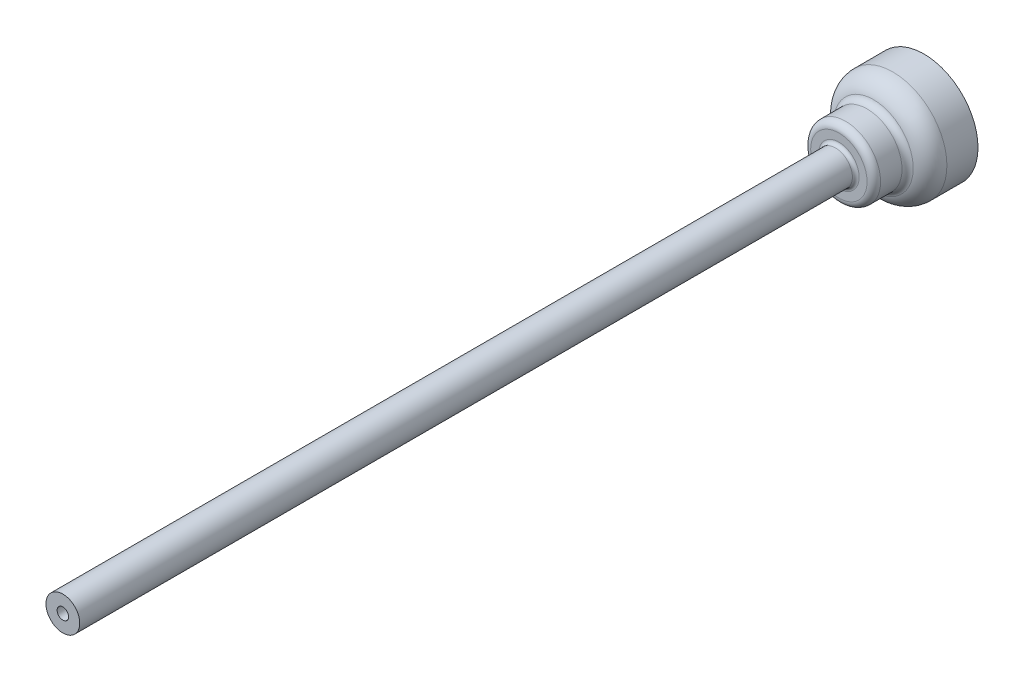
ISO-10303-21;
HEADER;
FILE_DESCRIPTION(('STEP AP214'),'2;1');
FILE_NAME('part.step','',(''),(''),'','','');
FILE_SCHEMA(('AUTOMOTIVE_DESIGN { 1 0 10303 214 1 1 1 1 }'));
ENDSEC;
DATA;
#1=APPLICATION_CONTEXT('core data for automotive mechanical design processes');
#2=APPLICATION_PROTOCOL_DEFINITION('international standard','automotive_design',2000,#1);
#3=PRODUCT_CONTEXT('',#1,'mechanical');
#4=PRODUCT('Part','Part','',(#3));
#5=PRODUCT_RELATED_PRODUCT_CATEGORY('part','',(#4));
#6=PRODUCT_DEFINITION_FORMATION('','',#4);
#7=PRODUCT_DEFINITION_CONTEXT('part definition',#1,'design');
#8=PRODUCT_DEFINITION('design','',#6,#7);
#9=PRODUCT_DEFINITION_SHAPE('','',#8);
#10=(LENGTH_UNIT() NAMED_UNIT(*) SI_UNIT(.MILLI.,.METRE.));
#11=(NAMED_UNIT(*) PLANE_ANGLE_UNIT() SI_UNIT($,.RADIAN.));
#12=(NAMED_UNIT(*) SI_UNIT($,.STERADIAN.) SOLID_ANGLE_UNIT());
#13=UNCERTAINTY_MEASURE_WITH_UNIT(LENGTH_MEASURE(1.E-05),#10,'distance_accuracy_value','');
#14=(GEOMETRIC_REPRESENTATION_CONTEXT(3) GLOBAL_UNCERTAINTY_ASSIGNED_CONTEXT((#13)) GLOBAL_UNIT_ASSIGNED_CONTEXT((#10,
#11,#12)) REPRESENTATION_CONTEXT('',''));
#15=CARTESIAN_POINT('',(0.,0.,0.));
#16=DIRECTION('',(0.,0.,1.));
#17=DIRECTION('',(1.,0.,0.));
#18=AXIS2_PLACEMENT_3D('',#15,#16,#17);
#19=CARTESIAN_POINT('',(0.,0.,50.));
#20=DIRECTION('',(0.,0.,-1.));
#21=DIRECTION('',(-1.,0.,0.));
#22=AXIS2_PLACEMENT_3D('',#19,#20,#21);
#23=CYLINDRICAL_SURFACE('',#22,0.55);
#24=CARTESIAN_POINT('',(0.,0.,46.9962214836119));
#25=DIRECTION('',(0.,0.,-1.));
#26=DIRECTION('',(-1.,0.,0.));
#27=AXIS2_PLACEMENT_3D('',#24,#25,#26);
#28=CIRCLE('',#27,0.55);
#29=CARTESIAN_POINT('',(0.55,0.,46.9962214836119));
#30=VERTEX_POINT('',#29);
#31=CARTESIAN_POINT('',(0.,-0.55,46.9962214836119));
#32=VERTEX_POINT('',#31);
#33=EDGE_CURVE('E147',#30,#32,#28,.T.);
#34=ORIENTED_EDGE('',*,*,#33,.T.);
#35=CARTESIAN_POINT('',(0.,0.,46.9962214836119));
#36=DIRECTION('',(0.,0.,-1.));
#37=DIRECTION('',(-1.,0.,0.));
#38=AXIS2_PLACEMENT_3D('',#35,#36,#37);
#39=CIRCLE('',#38,0.55);
#40=EDGE_CURVE('E162',#32,#30,#39,.T.);
#41=ORIENTED_EDGE('',*,*,#40,.T.);
#42=DIRECTION('',(0.,0.,1.));
#43=VECTOR('',#42,1.);
#44=CARTESIAN_POINT('',(0.55,0.,50.));
#45=LINE('',#44,#43);
#46=CARTESIAN_POINT('',(0.55,0.,70.));
#47=VERTEX_POINT('',#46);
#48=EDGE_CURVE('E11',#30,#47,#45,.T.);
#49=ORIENTED_EDGE('',*,*,#48,.T.);
#50=CARTESIAN_POINT('',(0.,0.,70.));
#51=DIRECTION('',(0.,0.,1.));
#52=DIRECTION('',(-1.,0.,0.));
#53=AXIS2_PLACEMENT_3D('',#50,#51,#52);
#54=CIRCLE('',#53,0.55);
#55=EDGE_CURVE('E180',#47,#47,#54,.T.);
#56=ORIENTED_EDGE('',*,*,#55,.T.);
#57=ORIENTED_EDGE('',*,*,#48,.F.);
#58=EDGE_LOOP('',(#34,#41,#49,#56,#57));
#59=FACE_BOUND('',#58,.T.);
#60=ADVANCED_FACE('F17',(#59),#23,.F.);
#61=CARTESIAN_POINT('',(0.,0.,50.));
#62=DIRECTION('',(0.,0.,1.));
#63=DIRECTION('',(-1.,0.,0.));
#64=AXIS2_PLACEMENT_3D('',#61,#62,#63);
#65=CYLINDRICAL_SURFACE('',#64,0.3429);
#66=CARTESIAN_POINT('',(0.,0.,72.5));
#67=DIRECTION('',(0.,0.,-1.));
#68=DIRECTION('',(-1.,0.,0.));
#69=AXIS2_PLACEMENT_3D('',#66,#67,#68);
#70=CIRCLE('',#69,0.3429);
#71=CARTESIAN_POINT('',(0.3429,0.,72.5));
#72=VERTEX_POINT('',#71);
#73=EDGE_CURVE('E163',#72,#72,#70,.T.);
#74=ORIENTED_EDGE('',*,*,#73,.F.);
#75=DIRECTION('',(0.,0.,-1.));
#76=VECTOR('',#75,1.);
#77=CARTESIAN_POINT('',(0.3429,0.,50.));
#78=LINE('',#77,#76);
#79=CARTESIAN_POINT('',(0.3429,0.,70.));
#80=VERTEX_POINT('',#79);
#81=EDGE_CURVE('E20',#72,#80,#78,.T.);
#82=ORIENTED_EDGE('',*,*,#81,.T.);
#83=CARTESIAN_POINT('',(0.,0.,70.));
#84=DIRECTION('',(0.,0.,-1.));
#85=DIRECTION('',(-1.,0.,0.));
#86=AXIS2_PLACEMENT_3D('',#83,#84,#85);
#87=CIRCLE('',#86,0.3429);
#88=EDGE_CURVE('E176',#80,#80,#87,.T.);
#89=ORIENTED_EDGE('',*,*,#88,.T.);
#90=ORIENTED_EDGE('',*,*,#81,.F.);
#91=EDGE_LOOP('',(#74,#82,#89,#90));
#92=FACE_BOUND('',#91,.T.);
#93=ADVANCED_FACE('F249',(#92),#65,.F.);
#94=CARTESIAN_POINT('',(0.,0.,52.5));
#95=DIRECTION('',(0.,0.,1.));
#96=DIRECTION('',(-1.,0.,0.));
#97=AXIS2_PLACEMENT_3D('',#94,#95,#96);
#98=CYLINDRICAL_SURFACE('',#97,0.85);
#99=CARTESIAN_POINT('',(0.,0.,172.5));
#100=DIRECTION('',(0.,0.,-1.));
#101=DIRECTION('',(-1.,0.,0.));
#102=AXIS2_PLACEMENT_3D('',#99,#100,#101);
#103=CIRCLE('',#102,0.85);
#104=CARTESIAN_POINT('',(0.85,0.,172.5));
#105=VERTEX_POINT('',#104);
#106=EDGE_CURVE('E140',#105,#105,#103,.T.);
#107=ORIENTED_EDGE('',*,*,#106,.F.);
#108=DIRECTION('',(0.,0.,-1.));
#109=VECTOR('',#108,1.);
#110=CARTESIAN_POINT('',(0.85,0.,52.5));
#111=LINE('',#110,#109);
#112=CARTESIAN_POINT('',(0.85,0.,72.5));
#113=VERTEX_POINT('',#112);
#114=EDGE_CURVE('E238',#105,#113,#111,.T.);
#115=ORIENTED_EDGE('',*,*,#114,.T.);
#116=CARTESIAN_POINT('',(0.,0.,72.5));
#117=DIRECTION('',(0.,0.,-1.));
#118=DIRECTION('',(-1.,0.,0.));
#119=AXIS2_PLACEMENT_3D('',#116,#117,#118);
#120=CIRCLE('',#119,0.85);
#121=EDGE_CURVE('E167',#113,#113,#120,.T.);
#122=ORIENTED_EDGE('',*,*,#121,.T.);
#123=ORIENTED_EDGE('',*,*,#114,.F.);
#124=EDGE_LOOP('',(#107,#115,#122,#123));
#125=FACE_BOUND('',#124,.T.);
#126=ADVANCED_FACE('F259',(#125),#98,.F.);
#127=CARTESIAN_POINT('',(0.,0.,50.));
#128=DIRECTION('',(0.,0.,-1.));
#129=DIRECTION('',(-1.,0.,0.));
#130=AXIS2_PLACEMENT_3D('',#127,#128,#129);
#131=CYLINDRICAL_SURFACE('',#130,8.);
#132=CARTESIAN_POINT('',(0.,0.,45.));
#133=DIRECTION('',(0.,0.,-1.));
#134=DIRECTION('',(-1.,0.,0.));
#135=AXIS2_PLACEMENT_3D('',#132,#133,#134);
#136=CIRCLE('',#135,8.);
#137=CARTESIAN_POINT('',(8.,0.,45.));
#138=VERTEX_POINT('',#137);
#139=CARTESIAN_POINT('',(0.,-8.,45.));
#140=VERTEX_POINT('',#139);
#141=EDGE_CURVE('E177',#138,#140,#136,.T.);
#142=ORIENTED_EDGE('',*,*,#141,.F.);
#143=DIRECTION('',(0.,0.,1.));
#144=VECTOR('',#143,1.);
#145=CARTESIAN_POINT('',(8.,0.,50.));
#146=LINE('',#145,#144);
#147=CARTESIAN_POINT('',(8.,0.,49.6051085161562));
#148=VERTEX_POINT('',#147);
#149=EDGE_CURVE('E38',#138,#148,#146,.T.);
#150=ORIENTED_EDGE('',*,*,#149,.T.);
#151=CARTESIAN_POINT('',(0.,0.,49.6051085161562));
#152=DIRECTION('',(0.,0.,1.));
#153=DIRECTION('',(1.,0.,0.));
#154=AXIS2_PLACEMENT_3D('',#151,#152,#153);
#155=CIRCLE('',#154,8.);
#156=CARTESIAN_POINT('',(-8.,0.,49.6051085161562));
#157=VERTEX_POINT('',#156);
#158=EDGE_CURVE('E154',#157,#148,#155,.T.);
#159=ORIENTED_EDGE('',*,*,#158,.F.);
#160=CARTESIAN_POINT('',(0.,0.,49.6051085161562));
#161=DIRECTION('',(0.,0.,1.));
#162=DIRECTION('',(1.,0.,0.));
#163=AXIS2_PLACEMENT_3D('',#160,#161,#162);
#164=CIRCLE('',#163,8.);
#165=EDGE_CURVE('E156',#148,#157,#164,.T.);
#166=ORIENTED_EDGE('',*,*,#165,.F.);
#167=ORIENTED_EDGE('',*,*,#149,.F.);
#168=CARTESIAN_POINT('',(0.,0.,45.));
#169=DIRECTION('',(0.,0.,-1.));
#170=DIRECTION('',(-1.,0.,0.));
#171=AXIS2_PLACEMENT_3D('',#168,#169,#170);
#172=CIRCLE('',#171,8.);
#173=EDGE_CURVE('E181',#140,#138,#172,.T.);
#174=ORIENTED_EDGE('',*,*,#173,.F.);
#175=EDGE_LOOP('',(#142,#150,#159,#166,#167,#174));
#176=FACE_BOUND('',#175,.T.);
#177=ADVANCED_FACE('F279',(#176),#131,.T.);
#178=CARTESIAN_POINT('',(0.,0.,49.6051085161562));
#179=DIRECTION('',(0.,0.,-1.));
#180=DIRECTION('',(1.,0.,0.));
#181=AXIS2_PLACEMENT_3D('',#178,#179,#180);
#182=TOROIDAL_SURFACE('',#181,5.,3.);
#183=ORIENTED_EDGE('',*,*,#158,.T.);
#184=ORIENTED_EDGE('',*,*,#165,.T.);
#185=CARTESIAN_POINT('',(-5.,0.,49.6051085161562));
#186=DIRECTION('',(0.,1.,0.));
#187=DIRECTION('',(-1.,0.,0.));
#188=AXIS2_PLACEMENT_3D('',#185,#186,#187);
#189=CIRCLE('',#188,3.);
#190=CARTESIAN_POINT('',(-5.88125,0.,52.4727553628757));
#191=VERTEX_POINT('',#190);
#192=EDGE_CURVE('E48',#157,#191,#189,.T.);
#193=ORIENTED_EDGE('',*,*,#192,.T.);
#194=CARTESIAN_POINT('',(0.,0.,52.4727553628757));
#195=DIRECTION('',(0.,0.,1.));
#196=DIRECTION('',(1.,0.,0.));
#197=AXIS2_PLACEMENT_3D('',#194,#195,#196);
#198=CIRCLE('',#197,5.88125);
#199=CARTESIAN_POINT('',(5.88125,0.,52.4727553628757));
#200=VERTEX_POINT('',#199);
#201=EDGE_CURVE('E227',#200,#191,#198,.T.);
#202=ORIENTED_EDGE('',*,*,#201,.F.);
#203=CARTESIAN_POINT('',(0.,0.,52.4727553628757));
#204=DIRECTION('',(0.,0.,1.));
#205=DIRECTION('',(1.,0.,0.));
#206=AXIS2_PLACEMENT_3D('',#203,#204,#205);
#207=CIRCLE('',#206,5.88125);
#208=EDGE_CURVE('E157',#191,#200,#207,.T.);
#209=ORIENTED_EDGE('',*,*,#208,.F.);
#210=ORIENTED_EDGE('',*,*,#192,.F.);
#211=EDGE_LOOP('',(#183,#184,#193,#202,#209,#210));
#212=FACE_BOUND('',#211,.T.);
#213=ADVANCED_FACE('F280',(#212),#182,.T.);
#214=CARTESIAN_POINT('',(0.,0.,53.4286376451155));
#215=DIRECTION('',(0.,0.,-1.));
#216=DIRECTION('',(-1.,0.,0.));
#217=AXIS2_PLACEMENT_3D('',#214,#215,#216);
#218=TOROIDAL_SURFACE('',#217,6.175,1.);
#219=CARTESIAN_POINT('',(0.,0.,53.4286376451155));
#220=DIRECTION('',(0.,0.,-1.));
#221=DIRECTION('',(1.,0.,0.));
#222=AXIS2_PLACEMENT_3D('',#219,#220,#221);
#223=CIRCLE('',#222,5.175);
#224=CARTESIAN_POINT('',(5.175,0.,53.4286376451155));
#225=VERTEX_POINT('',#224);
#226=EDGE_CURVE('E213',#225,#225,#223,.T.);
#227=ORIENTED_EDGE('',*,*,#226,.T.);
#228=CARTESIAN_POINT('',(6.175,0.,53.4286376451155));
#229=DIRECTION('',(0.,-1.,0.));
#230=DIRECTION('',(1.,0.,0.));
#231=AXIS2_PLACEMENT_3D('',#228,#229,#230);
#232=CIRCLE('',#231,1.);
#233=EDGE_CURVE('E223',#225,#200,#232,.T.);
#234=ORIENTED_EDGE('',*,*,#233,.T.);
#235=ORIENTED_EDGE('',*,*,#201,.T.);
#236=ORIENTED_EDGE('',*,*,#208,.T.);
#237=ORIENTED_EDGE('',*,*,#233,.F.);
#238=EDGE_LOOP('',(#227,#234,#235,#236,#237));
#239=FACE_BOUND('',#238,.T.);
#240=ADVANCED_FACE('F282',(#239),#218,.F.);
#241=CARTESIAN_POINT('',(0.,0.,52.6));
#242=DIRECTION('',(0.,0.,1.));
#243=DIRECTION('',(-1.,0.,0.));
#244=AXIS2_PLACEMENT_3D('',#241,#242,#243);
#245=CYLINDRICAL_SURFACE('',#244,5.175);
#246=CARTESIAN_POINT('',(0.,0.,56.6));
#247=DIRECTION('',(0.,0.,1.));
#248=DIRECTION('',(-1.,0.,0.));
#249=AXIS2_PLACEMENT_3D('',#246,#247,#248);
#250=CIRCLE('',#249,5.175);
#251=CARTESIAN_POINT('',(5.175,0.,56.6));
#252=VERTEX_POINT('',#251);
#253=CARTESIAN_POINT('',(-5.175,0.,56.6));
#254=VERTEX_POINT('',#253);
#255=EDGE_CURVE('E214',#252,#254,#250,.T.);
#256=ORIENTED_EDGE('',*,*,#255,.F.);
#257=DIRECTION('',(0.,0.,-1.));
#258=VECTOR('',#257,1.);
#259=CARTESIAN_POINT('',(5.175,0.,52.6));
#260=LINE('',#259,#258);
#261=EDGE_CURVE('E209',#252,#225,#260,.T.);
#262=ORIENTED_EDGE('',*,*,#261,.T.);
#263=ORIENTED_EDGE('',*,*,#226,.F.);
#264=ORIENTED_EDGE('',*,*,#261,.F.);
#265=CARTESIAN_POINT('',(0.,0.,56.6));
#266=DIRECTION('',(0.,0.,1.));
#267=DIRECTION('',(-1.,0.,0.));
#268=AXIS2_PLACEMENT_3D('',#265,#266,#267);
#269=CIRCLE('',#268,5.175);
#270=EDGE_CURVE('E208',#254,#252,#269,.T.);
#271=ORIENTED_EDGE('',*,*,#270,.F.);
#272=EDGE_LOOP('',(#256,#262,#263,#264,#271));
#273=FACE_BOUND('',#272,.T.);
#274=ADVANCED_FACE('F288',(#273),#245,.T.);
#275=CARTESIAN_POINT('',(0.,0.,56.6));
#276=DIRECTION('',(0.,0.,1.));
#277=DIRECTION('',(1.,0.,0.));
#278=AXIS2_PLACEMENT_3D('',#275,#276,#277);
#279=TOROIDAL_SURFACE('',#278,4.175,1.);
#280=CARTESIAN_POINT('',(0.,0.,57.6));
#281=DIRECTION('',(0.,0.,-1.));
#282=DIRECTION('',(-1.,0.,0.));
#283=AXIS2_PLACEMENT_3D('',#280,#281,#282);
#284=CIRCLE('',#283,4.175);
#285=CARTESIAN_POINT('',(-4.175,0.,57.6));
#286=VERTEX_POINT('',#285);
#287=EDGE_CURVE('E135',#286,#286,#284,.T.);
#288=ORIENTED_EDGE('',*,*,#287,.T.);
#289=CARTESIAN_POINT('',(-4.175,0.,56.6));
#290=DIRECTION('',(0.,-1.,0.));
#291=DIRECTION('',(-1.,0.,0.));
#292=AXIS2_PLACEMENT_3D('',#289,#290,#291);
#293=CIRCLE('',#292,1.);
#294=EDGE_CURVE('E134',#286,#254,#293,.T.);
#295=ORIENTED_EDGE('',*,*,#294,.T.);
#296=ORIENTED_EDGE('',*,*,#270,.T.);
#297=ORIENTED_EDGE('',*,*,#255,.T.);
#298=ORIENTED_EDGE('',*,*,#294,.F.);
#299=EDGE_LOOP('',(#288,#295,#296,#297,#298));
#300=FACE_BOUND('',#299,.T.);
#301=ADVANCED_FACE('F334',(#300),#279,.T.);
#302=CARTESIAN_POINT('',(0.,0.,52.5));
#303=DIRECTION('',(0.,0.,1.));
#304=DIRECTION('',(-1.,0.,0.));
#305=AXIS2_PLACEMENT_3D('',#302,#303,#304);
#306=CYLINDRICAL_SURFACE('',#305,2.5);
#307=CARTESIAN_POINT('',(0.,0.,172.5));
#308=DIRECTION('',(0.,0.,1.));
#309=DIRECTION('',(-1.,0.,0.));
#310=AXIS2_PLACEMENT_3D('',#307,#308,#309);
#311=CIRCLE('',#310,2.5);
#312=CARTESIAN_POINT('',(2.5,0.,172.5));
#313=VERTEX_POINT('',#312);
#314=EDGE_CURVE('E129',#313,#313,#311,.T.);
#315=ORIENTED_EDGE('',*,*,#314,.F.);
#316=DIRECTION('',(0.,0.,-1.));
#317=VECTOR('',#316,1.);
#318=CARTESIAN_POINT('',(2.5,0.,52.5));
#319=LINE('',#318,#317);
#320=CARTESIAN_POINT('',(2.5,0.,58.1));
#321=VERTEX_POINT('',#320);
#322=EDGE_CURVE('E126',#313,#321,#319,.T.);
#323=ORIENTED_EDGE('',*,*,#322,.T.);
#324=CARTESIAN_POINT('',(0.,0.,58.1));
#325=DIRECTION('',(0.,0.,-1.));
#326=DIRECTION('',(-1.,0.,0.));
#327=AXIS2_PLACEMENT_3D('',#324,#325,#326);
#328=CIRCLE('',#327,2.5);
#329=CARTESIAN_POINT('',(-2.5,0.,58.1));
#330=VERTEX_POINT('',#329);
#331=EDGE_CURVE('E150',#330,#321,#328,.T.);
#332=ORIENTED_EDGE('',*,*,#331,.F.);
#333=CARTESIAN_POINT('',(0.,0.,58.1));
#334=DIRECTION('',(0.,0.,-1.));
#335=DIRECTION('',(-1.,0.,0.));
#336=AXIS2_PLACEMENT_3D('',#333,#334,#335);
#337=CIRCLE('',#336,2.5);
#338=EDGE_CURVE('E131',#321,#330,#337,.T.);
#339=ORIENTED_EDGE('',*,*,#338,.F.);
#340=ORIENTED_EDGE('',*,*,#322,.F.);
#341=EDGE_LOOP('',(#315,#323,#332,#339,#340));
#342=FACE_BOUND('',#341,.T.);
#343=ADVANCED_FACE('F128',(#342),#306,.T.);
#344=CARTESIAN_POINT('',(0.,0.,57.6));
#345=DIRECTION('',(0.,0.,1.));
#346=DIRECTION('',(1.,0.,0.));
#347=AXIS2_PLACEMENT_3D('',#344,#345,#346);
#348=PLANE('',#347);
#349=CARTESIAN_POINT('',(0.,0.,57.6));
#350=DIRECTION('',(0.,0.,1.));
#351=DIRECTION('',(-1.,0.,0.));
#352=AXIS2_PLACEMENT_3D('',#349,#350,#351);
#353=CIRCLE('',#352,3.);
#354=CARTESIAN_POINT('',(-3.,0.,57.6));
#355=VERTEX_POINT('',#354);
#356=EDGE_CURVE('E166',#355,#355,#353,.T.);
#357=ORIENTED_EDGE('',*,*,#356,.F.);
#358=EDGE_LOOP('',(#357));
#359=FACE_BOUND('',#358,.T.);
#360=ORIENTED_EDGE('',*,*,#287,.F.);
#361=EDGE_LOOP('',(#360));
#362=FACE_BOUND('',#361,.T.);
#363=ADVANCED_FACE('F354',(#359,#362),#348,.T.);
#364=CARTESIAN_POINT('',(0.,0.,58.1));
#365=DIRECTION('',(0.,0.,1.));
#366=DIRECTION('',(1.,0.,0.));
#367=AXIS2_PLACEMENT_3D('',#364,#365,#366);
#368=TOROIDAL_SURFACE('',#367,3.,0.5);
#369=ORIENTED_EDGE('',*,*,#356,.T.);
#370=CARTESIAN_POINT('',(-3.,0.,58.1));
#371=DIRECTION('',(0.,-1.,0.));
#372=DIRECTION('',(-1.,0.,0.));
#373=AXIS2_PLACEMENT_3D('',#370,#371,#372);
#374=CIRCLE('',#373,0.5);
#375=EDGE_CURVE('E153',#355,#330,#374,.T.);
#376=ORIENTED_EDGE('',*,*,#375,.T.);
#377=ORIENTED_EDGE('',*,*,#331,.T.);
#378=ORIENTED_EDGE('',*,*,#338,.T.);
#379=ORIENTED_EDGE('',*,*,#375,.F.);
#380=EDGE_LOOP('',(#369,#376,#377,#378,#379));
#381=FACE_BOUND('',#380,.T.);
#382=ADVANCED_FACE('F256',(#381),#368,.F.);
#383=CARTESIAN_POINT('',(0.,0.,72.5));
#384=DIRECTION('',(0.,0.,1.));
#385=DIRECTION('',(1.,0.,0.));
#386=AXIS2_PLACEMENT_3D('',#383,#384,#385);
#387=PLANE('',#386);
#388=ORIENTED_EDGE('',*,*,#73,.T.);
#389=EDGE_LOOP('',(#388));
#390=FACE_BOUND('',#389,.T.);
#391=ORIENTED_EDGE('',*,*,#121,.F.);
#392=EDGE_LOOP('',(#391));
#393=FACE_BOUND('',#392,.T.);
#394=ADVANCED_FACE('F252',(#390,#393),#387,.T.);
#395=CARTESIAN_POINT('',(0.,0.,70.));
#396=DIRECTION('',(0.,0.,1.));
#397=DIRECTION('',(1.,0.,0.));
#398=AXIS2_PLACEMENT_3D('',#395,#396,#397);
#399=PLANE('',#398);
#400=ORIENTED_EDGE('',*,*,#88,.F.);
#401=EDGE_LOOP('',(#400));
#402=FACE_BOUND('',#401,.T.);
#403=ORIENTED_EDGE('',*,*,#55,.F.);
#404=EDGE_LOOP('',(#403));
#405=FACE_BOUND('',#404,.T.);
#406=ADVANCED_FACE('F255',(#402,#405),#399,.F.);
#407=CARTESIAN_POINT('',(0.,0.,46.0717967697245));
#408=DIRECTION('',(0.,0.,-1.));
#409=DIRECTION('',(0.,1.,0.));
#410=AXIS2_PLACEMENT_3D('',#407,#408,#409);
#411=CONICAL_SURFACE('',#410,4.,1.30899693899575);
#412=ORIENTED_EDGE('',*,*,#33,.F.);
#413=ORIENTED_EDGE('',*,*,#40,.F.);
#414=DIRECTION('',(0.,-0.965925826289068,-0.258819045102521));
#415=VECTOR('',#414,1.);
#416=CARTESIAN_POINT('',(0.,-4.,46.0717967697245));
#417=LINE('',#416,#415);
#418=EDGE_CURVE('E172',#32,#140,#417,.T.);
#419=ORIENTED_EDGE('',*,*,#418,.T.);
#420=ORIENTED_EDGE('',*,*,#173,.T.);
#421=ORIENTED_EDGE('',*,*,#141,.T.);
#422=ORIENTED_EDGE('',*,*,#418,.F.);
#423=EDGE_LOOP('',(#412,#413,#419,#420,#421,#422));
#424=FACE_BOUND('',#423,.T.);
#425=ADVANCED_FACE('F262',(#424),#411,.F.);
#426=CARTESIAN_POINT('',(0.,0.,172.5));
#427=DIRECTION('',(0.,0.,1.));
#428=DIRECTION('',(1.,0.,0.));
#429=AXIS2_PLACEMENT_3D('',#426,#427,#428);
#430=PLANE('',#429);
#431=ORIENTED_EDGE('',*,*,#106,.T.);
#432=EDGE_LOOP('',(#431));
#433=FACE_BOUND('',#432,.T.);
#434=ORIENTED_EDGE('',*,*,#314,.T.);
#435=EDGE_LOOP('',(#434));
#436=FACE_BOUND('',#435,.T.);
#437=ADVANCED_FACE('F138',(#433,#436),#430,.T.);
#438=CLOSED_SHELL('',(#60,#93,#126,#177,#213,#240,#274,#301,#343,#363,#382,#394,#406,#425,#437));
#439=MANIFOLD_SOLID_BREP('B1',#438);
#440=ADVANCED_BREP_SHAPE_REPRESENTATION('',(#18,#439),#14);
#441=SHAPE_DEFINITION_REPRESENTATION(#9,#440);
ENDSEC;
END-ISO-10303-21;
